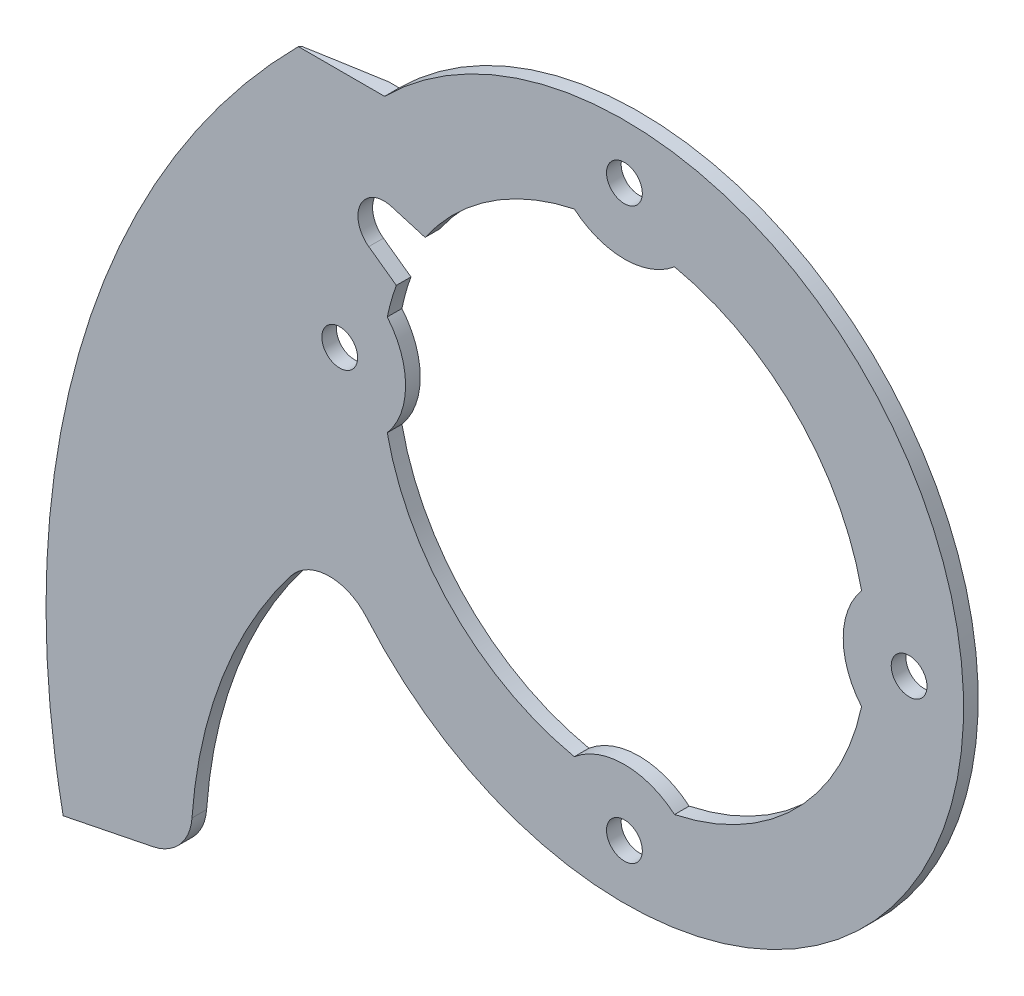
ISO-10303-21;
HEADER;
FILE_DESCRIPTION(('STEP AP214'),'2;1');
FILE_NAME('part.step','',(''),(''),'','','');
FILE_SCHEMA(('AUTOMOTIVE_DESIGN { 1 0 10303 214 1 1 1 1 }'));
ENDSEC;
DATA;
#1=APPLICATION_CONTEXT('core data for automotive mechanical design processes');
#2=APPLICATION_PROTOCOL_DEFINITION('international standard','automotive_design',2000,#1);
#3=PRODUCT_CONTEXT('',#1,'mechanical');
#4=PRODUCT('Part','Part','',(#3));
#5=PRODUCT_RELATED_PRODUCT_CATEGORY('part','',(#4));
#6=PRODUCT_DEFINITION_FORMATION('','',#4);
#7=PRODUCT_DEFINITION_CONTEXT('part definition',#1,'design');
#8=PRODUCT_DEFINITION('design','',#6,#7);
#9=PRODUCT_DEFINITION_SHAPE('','',#8);
#10=(LENGTH_UNIT() NAMED_UNIT(*) SI_UNIT(.MILLI.,.METRE.));
#11=(NAMED_UNIT(*) PLANE_ANGLE_UNIT() SI_UNIT($,.RADIAN.));
#12=(NAMED_UNIT(*) SI_UNIT($,.STERADIAN.) SOLID_ANGLE_UNIT());
#13=UNCERTAINTY_MEASURE_WITH_UNIT(LENGTH_MEASURE(1.E-05),#10,'distance_accuracy_value','');
#14=(GEOMETRIC_REPRESENTATION_CONTEXT(3) GLOBAL_UNCERTAINTY_ASSIGNED_CONTEXT((#13)) GLOBAL_UNIT_ASSIGNED_CONTEXT((#10,
#11,#12)) REPRESENTATION_CONTEXT('',''));
#15=CARTESIAN_POINT('',(0.,0.,0.));
#16=DIRECTION('',(0.,0.,1.));
#17=DIRECTION('',(1.,0.,0.));
#18=AXIS2_PLACEMENT_3D('',#15,#16,#17);
#19=CARTESIAN_POINT('',(17.7955101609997,-22.8663632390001,0.));
#20=DIRECTION('',(0.,0.,1.));
#21=DIRECTION('',(1.,0.,0.));
#22=AXIS2_PLACEMENT_3D('',#19,#20,#21);
#23=CONICAL_SURFACE('',#22,50.150198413,1.32581766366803);
#24=CARTESIAN_POINT('',(-19.9446279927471,14.743176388,0.782537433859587));
#25=CARTESIAN_POINT('',(-19.3538180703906,14.743176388,0.677917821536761));
#26=CARTESIAN_POINT('',(-18.7627981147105,14.743176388,0.574479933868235));
#27=CARTESIAN_POINT('',(-17.7064564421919,14.7431763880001,0.391956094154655));
#28=CARTESIAN_POINT('',(-17.241218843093,14.7431763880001,0.31238291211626));
#29=CARTESIAN_POINT('',(-16.3104542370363,14.7431763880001,0.154911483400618));
#30=CARTESIAN_POINT('',(-15.8449272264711,14.7431763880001,0.0770132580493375));
#31=CARTESIAN_POINT('',(-15.3792532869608,14.7431763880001,-2.00006677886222E-10));
#32=B_SPLINE_CURVE_WITH_KNOTS('',3,(#24,#25,#26,#27,#28,#29,#30,#31),.UNSPECIFIED.,.F.,.F.,(4,2,
2,4),(0.,1.80000381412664,3.21598166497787,4.63197753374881),.UNSPECIFIED.);
#33=CARTESIAN_POINT('',(-19.9446279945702,14.743176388,0.782537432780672));
#34=VERTEX_POINT('',#33);
#35=CARTESIAN_POINT('',(-15.3792532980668,14.7431763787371,-9.99755833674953E-11));
#36=VERTEX_POINT('',#35);
#37=EDGE_CURVE('E38',#34,#36,#32,.T.);
#38=ORIENTED_EDGE('',*,*,#37,.T.);
#39=CARTESIAN_POINT('',(17.7955101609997,-22.8663632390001,0.));
#40=DIRECTION('',(0.,0.,1.));
#41=DIRECTION('',(1.,0.,0.));
#42=AXIS2_PLACEMENT_3D('',#39,#40,#41);
#43=CIRCLE('',#42,50.150198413);
#44=CARTESIAN_POINT('',(-31.3607486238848,-32.8013832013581,0.));
#45=VERTEX_POINT('',#44);
#46=EDGE_CURVE('E377',#36,#45,#43,.T.);
#47=ORIENTED_EDGE('',*,*,#46,.T.);
#48=CARTESIAN_POINT('',(-31.3607486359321,-32.801383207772,7.06931158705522E-13));
#49=CARTESIAN_POINT('',(-31.488586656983,-32.8272206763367,0.032605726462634));
#50=CARTESIAN_POINT('',(-31.6164246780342,-32.8530581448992,0.0652114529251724));
#51=CARTESIAN_POINT('',(-31.8721007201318,-32.9047330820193,0.13042290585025));
#52=CARTESIAN_POINT('',(-31.9999387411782,-32.9305705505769,0.163028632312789));
#53=CARTESIAN_POINT('',(-32.2556147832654,-32.982245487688,0.228240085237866));
#54=CARTESIAN_POINT('',(-32.3834528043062,-33.0080829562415,0.260845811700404));
#55=CARTESIAN_POINT('',(-32.6391288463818,-33.059757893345,0.326057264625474));
#56=CARTESIAN_POINT('',(-32.7669668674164,-33.085595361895,0.358662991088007));
#57=CARTESIAN_POINT('',(-33.0226429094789,-33.1372702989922,0.423874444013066));
#58=CARTESIAN_POINT('',(-33.1504809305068,-33.1631077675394,0.456480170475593));
#59=CARTESIAN_POINT('',(-33.4061569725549,-33.2147827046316,0.521691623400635));
#60=CARTESIAN_POINT('',(-33.5339949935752,-33.2406201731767,0.554297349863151));
#61=CARTESIAN_POINT('',(-33.7896710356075,-33.2922951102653,0.619508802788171));
#62=CARTESIAN_POINT('',(-33.9175090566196,-33.3181325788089,0.652114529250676));
#63=CARTESIAN_POINT('',(-34.1731850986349,-33.3698075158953,0.717325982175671));
#64=CARTESIAN_POINT('',(-34.3010231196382,-33.3956449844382,0.749931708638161));
#65=CARTESIAN_POINT('',(-34.4288611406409,-33.4214824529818,0.782537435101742));
#66=B_SPLINE_CURVE_WITH_KNOTS('',3,(#48,#49,#50,#51,#52,#53,#54,#55,#56,#57,#58,#59,#60,#61,#62,
#63,#64,#65),.UNSPECIFIED.,.F.,.F.,(4,2,2,2,2,2,2,2,4),(0.,0.403310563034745,0.806621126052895,
1.20993168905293,1.61324225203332,2.01655281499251,2.41986337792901,2.82317394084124,
3.22648450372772),.UNSPECIFIED.);
#67=CARTESIAN_POINT('',(-34.4288611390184,-33.4214824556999,0.782537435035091));
#68=VERTEX_POINT('',#67);
#69=EDGE_CURVE('E319',#45,#68,#66,.T.);
#70=ORIENTED_EDGE('',*,*,#69,.T.);
#71=CARTESIAN_POINT('',(17.7955101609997,-22.8663632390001,0.782537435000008));
#72=DIRECTION('',(0.,0.,1.));
#73=DIRECTION('',(1.,0.,0.));
#74=AXIS2_PLACEMENT_3D('',#71,#72,#73);
#75=CIRCLE('',#74,53.280348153);
#76=EDGE_CURVE('E181',#34,#68,#75,.T.);
#77=ORIENTED_EDGE('',*,*,#76,.F.);
#78=EDGE_LOOP('',(#38,#47,#70,#77));
#79=FACE_BOUND('',#78,.T.);
#80=ADVANCED_FACE('F34',(#79),#23,.T.);
#81=CARTESIAN_POINT('',(-28.97955061,-32.320116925,0.));
#82=DIRECTION('',(-0.198105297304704,0.980180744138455,0.));
#83=DIRECTION('',(-0.980180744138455,-0.198105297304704,0.));
#84=AXIS2_PLACEMENT_3D('',#81,#82,#83);
#85=PLANE('',#84);
#86=DIRECTION('',(0.,0.,-1.));
#87=VECTOR('',#86,1.);
#88=CARTESIAN_POINT('',(-28.9795506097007,-32.3201169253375,0.450000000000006));
#89=LINE('',#88,#87);
#90=CARTESIAN_POINT('',(-28.9795506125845,-32.3201169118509,0.899999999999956));
#91=VERTEX_POINT('',#90);
#92=CARTESIAN_POINT('',(-28.9795506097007,-32.3201169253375,0.));
#93=VERTEX_POINT('',#92);
#94=EDGE_CURVE('E317',#91,#93,#89,.T.);
#95=ORIENTED_EDGE('',*,*,#94,.F.);
#96=CARTESIAN_POINT('',(-34.4973270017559,-33.4353201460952,0.900000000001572));
#97=CARTESIAN_POINT('',(-34.2674196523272,-33.3888533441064,0.900000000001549));
#98=CARTESIAN_POINT('',(-34.0375123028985,-33.3423865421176,0.900000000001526));
#99=CARTESIAN_POINT('',(-33.5776976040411,-33.2494529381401,0.900000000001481));
#100=CARTESIAN_POINT('',(-33.3477902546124,-33.2029861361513,0.900000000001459));
#101=CARTESIAN_POINT('',(-32.887975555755,-33.1100525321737,0.900000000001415));
#102=CARTESIAN_POINT('',(-32.6580682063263,-33.0635857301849,0.900000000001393));
#103=CARTESIAN_POINT('',(-32.1982535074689,-32.9706521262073,0.900000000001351));
#104=CARTESIAN_POINT('',(-31.9683461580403,-32.9241853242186,0.900000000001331));
#105=CARTESIAN_POINT('',(-31.508531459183,-32.831251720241,0.900000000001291));
#106=CARTESIAN_POINT('',(-31.2786241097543,-32.7847849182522,0.900000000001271));
#107=CARTESIAN_POINT('',(-30.8188094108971,-32.6918513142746,0.900000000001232));
#108=CARTESIAN_POINT('',(-30.5889020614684,-32.6453845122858,0.900000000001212));
#109=CARTESIAN_POINT('',(-30.1290873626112,-32.5524509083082,0.900000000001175));
#110=CARTESIAN_POINT('',(-29.8991800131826,-32.5059841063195,0.900000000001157));
#111=CARTESIAN_POINT('',(-29.4393653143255,-32.4130505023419,0.90000000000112));
#112=CARTESIAN_POINT('',(-29.2094579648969,-32.3665837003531,0.900000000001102));
#113=CARTESIAN_POINT('',(-28.9795506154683,-32.3201168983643,0.900000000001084));
#114=B_SPLINE_CURVE_WITH_KNOTS('',3,(#96,#97,#98,#99,#100,#101,#102,#103,#104,#105,#106,#107,
#108,#109,#110,#111,#112,#113),.UNSPECIFIED.,.F.,.F.,(4,2,2,2,2,2,2,2,4),(0.,0.70366822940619,
1.40733645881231,2.11100468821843,2.81467291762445,3.51834114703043,4.22200937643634,
4.92567760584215,5.62934583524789),.UNSPECIFIED.);
#115=CARTESIAN_POINT('',(-34.4973270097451,-33.4353201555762,0.89947726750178));
#116=VERTEX_POINT('',#115);
#117=EDGE_CURVE('E263',#116,#91,#114,.T.);
#118=ORIENTED_EDGE('',*,*,#117,.F.);
#119=DIRECTION('',(-0.504298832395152,-0.1019243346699,0.857492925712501));
#120=VECTOR('',#119,1.);
#121=CARTESIAN_POINT('',(-34.4630940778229,-33.4284013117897,0.840745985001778));
#122=LINE('',#121,#120);
#123=EDGE_CURVE('E204',#68,#116,#122,.T.);
#124=ORIENTED_EDGE('',*,*,#123,.F.);
#125=ORIENTED_EDGE('',*,*,#69,.F.);
#126=CARTESIAN_POINT('',(-31.3607486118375,-32.8013831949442,1.60786851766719E-12));
#127=CARTESIAN_POINT('',(-31.2615320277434,-32.7813304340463,1.59698065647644E-12));
#128=CARTESIAN_POINT('',(-31.1623154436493,-32.7612776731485,1.58617665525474E-12));
#129=CARTESIAN_POINT('',(-30.9638822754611,-32.7211721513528,1.56473456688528E-12));
#130=CARTESIAN_POINT('',(-30.864665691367,-32.7011193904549,1.55409647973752E-12));
#131=CARTESIAN_POINT('',(-30.6662325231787,-32.6610138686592,1.53298441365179E-12));
#132=CARTESIAN_POINT('',(-30.5670159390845,-32.6409611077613,1.52251043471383E-12));
#133=CARTESIAN_POINT('',(-30.3685827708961,-32.6008555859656,1.50172479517E-12));
#134=CARTESIAN_POINT('',(-30.2693661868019,-32.5808028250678,1.49141313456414E-12));
#135=CARTESIAN_POINT('',(-30.0709330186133,-32.5406973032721,1.47095035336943E-12));
#136=CARTESIAN_POINT('',(-29.971716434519,-32.5206445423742,1.46079923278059E-12));
#137=CARTESIAN_POINT('',(-29.7732832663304,-32.4805390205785,1.44065576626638E-12));
#138=CARTESIAN_POINT('',(-29.6740666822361,-32.4604862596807,1.43066342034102E-12));
#139=CARTESIAN_POINT('',(-29.4756335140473,-32.420380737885,1.41083574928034E-12));
#140=CARTESIAN_POINT('',(-29.3764169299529,-32.4003279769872,1.40100042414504E-12));
#141=CARTESIAN_POINT('',(-29.1779837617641,-32.3602224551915,1.38148505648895E-12));
#142=CARTESIAN_POINT('',(-29.0787671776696,-32.3401696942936,1.37180501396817E-12));
#143=CARTESIAN_POINT('',(-28.9795505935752,-32.3201169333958,1.36220174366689E-12));
#144=B_SPLINE_CURVE_WITH_KNOTS('',3,(#126,#127,#128,#129,#130,#131,#132,#133,#134,#135,#136,
#137,#138,#139,#140,#141,#142,#143),.UNSPECIFIED.,.F.,.F.,(4,2,2,2,2,2,2,2,4),(0.,
0.303668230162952,0.607336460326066,0.911004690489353,1.21467292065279,1.51834115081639,
1.82200938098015,2.12567761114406,2.42934584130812),.UNSPECIFIED.);
#145=EDGE_CURVE('E380',#45,#93,#144,.T.);
#146=ORIENTED_EDGE('',*,*,#145,.T.);
#147=EDGE_LOOP('',(#95,#118,#124,#125,#146));
#148=FACE_BOUND('',#147,.T.);
#149=ADVANCED_FACE('F345',(#148),#85,.F.);
#150=CARTESIAN_POINT('',(-29.573866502,-29.379574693,0.899999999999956));
#151=DIRECTION('',(0.,0.,-1.));
#152=DIRECTION('',(-1.,0.,0.));
#153=AXIS2_PLACEMENT_3D('',#150,#151,#152);
#154=CYLINDRICAL_SURFACE('',#153,3.);
#155=CARTESIAN_POINT('',(-29.573866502,-29.379574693,0.));
#156=DIRECTION('',(0.,0.,-1.));
#157=DIRECTION('',(-1.,0.,0.));
#158=AXIS2_PLACEMENT_3D('',#155,#156,#157);
#159=CIRCLE('',#158,3.);
#160=CARTESIAN_POINT('',(-26.5814833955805,-29.5932177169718,0.));
#161=VERTEX_POINT('',#160);
#162=EDGE_CURVE('E381',#93,#161,#159,.F.);
#163=ORIENTED_EDGE('',*,*,#162,.T.);
#164=DIRECTION('',(0.,0.,1.));
#165=VECTOR('',#164,1.);
#166=CARTESIAN_POINT('',(-26.5814833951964,-29.5932177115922,0.450000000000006));
#167=LINE('',#166,#165);
#168=CARTESIAN_POINT('',(-26.5814833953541,-29.593217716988,0.900000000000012));
#169=VERTEX_POINT('',#168);
#170=EDGE_CURVE('E314',#161,#169,#167,.T.);
#171=ORIENTED_EDGE('',*,*,#170,.T.);
#172=CARTESIAN_POINT('',(-29.573866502,-29.379574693,0.899999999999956));
#173=DIRECTION('',(0.,0.,-1.));
#174=DIRECTION('',(-1.,0.,0.));
#175=AXIS2_PLACEMENT_3D('',#172,#173,#174);
#176=CIRCLE('',#175,3.);
#177=EDGE_CURVE('E265',#91,#169,#176,.F.);
#178=ORIENTED_EDGE('',*,*,#177,.F.);
#179=ORIENTED_EDGE('',*,*,#94,.T.);
#180=EDGE_LOOP('',(#163,#171,#178,#179));
#181=FACE_BOUND('',#180,.T.);
#182=ADVANCED_FACE('F336',(#181),#154,.T.);
#183=CARTESIAN_POINT('',(2.81403907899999,-31.6919291,0.900000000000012));
#184=DIRECTION('',(0.,0.,-1.));
#185=DIRECTION('',(-1.,0.,0.));
#186=AXIS2_PLACEMENT_3D('',#183,#184,#185);
#187=CYLINDRICAL_SURFACE('',#186,29.470346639);
#188=ORIENTED_EDGE('',*,*,#170,.F.);
#189=CARTESIAN_POINT('',(2.81403907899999,-31.6919291,0.));
#190=DIRECTION('',(0.,0.,-1.));
#191=DIRECTION('',(-1.,0.,0.));
#192=AXIS2_PLACEMENT_3D('',#189,#190,#191);
#193=CIRCLE('',#192,29.470346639);
#194=CARTESIAN_POINT('',(-20.4997424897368,-13.665034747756,0.));
#195=VERTEX_POINT('',#194);
#196=EDGE_CURVE('E384',#161,#195,#193,.T.);
#197=ORIENTED_EDGE('',*,*,#196,.T.);
#198=DIRECTION('',(0.,0.,1.));
#199=VECTOR('',#198,1.);
#200=CARTESIAN_POINT('',(-20.4997424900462,-13.6650347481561,0.450000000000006));
#201=LINE('',#200,#199);
#202=CARTESIAN_POINT('',(-20.499742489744,-13.6650347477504,0.900000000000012));
#203=VERTEX_POINT('',#202);
#204=EDGE_CURVE('E311',#195,#203,#201,.T.);
#205=ORIENTED_EDGE('',*,*,#204,.T.);
#206=CARTESIAN_POINT('',(2.81403907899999,-31.6919291,0.900000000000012));
#207=DIRECTION('',(0.,0.,-1.));
#208=DIRECTION('',(-1.,0.,0.));
#209=AXIS2_PLACEMENT_3D('',#206,#207,#208);
#210=CIRCLE('',#209,29.470346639);
#211=EDGE_CURVE('E427',#169,#203,#210,.T.);
#212=ORIENTED_EDGE('',*,*,#211,.F.);
#213=EDGE_LOOP('',(#188,#197,#205,#212));
#214=FACE_BOUND('',#213,.T.);
#215=ADVANCED_FACE('F344',(#214),#187,.F.);
#216=CARTESIAN_POINT('',(-18.126463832,-15.500122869,0.900000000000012));
#217=DIRECTION('',(0.,0.,-1.));
#218=DIRECTION('',(-1.,0.,0.));
#219=AXIS2_PLACEMENT_3D('',#216,#217,#218);
#220=CYLINDRICAL_SURFACE('',#219,3.);
#221=ORIENTED_EDGE('',*,*,#204,.F.);
#222=CARTESIAN_POINT('',(-18.126463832,-15.500122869,0.));
#223=DIRECTION('',(0.,0.,-1.));
#224=DIRECTION('',(-1.,0.,0.));
#225=AXIS2_PLACEMENT_3D('',#222,#223,#224);
#226=CIRCLE('',#225,3.);
#227=CARTESIAN_POINT('',(-15.8464054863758,-13.5504218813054,0.));
#228=VERTEX_POINT('',#227);
#229=EDGE_CURVE('E276',#195,#228,#226,.T.);
#230=ORIENTED_EDGE('',*,*,#229,.T.);
#231=DIRECTION('',(0.,0.,-1.));
#232=VECTOR('',#231,1.);
#233=CARTESIAN_POINT('',(-15.8464054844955,-13.5504218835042,0.450000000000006));
#234=LINE('',#233,#232);
#235=CARTESIAN_POINT('',(-15.8464054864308,-13.5504218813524,0.900000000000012));
#236=VERTEX_POINT('',#235);
#237=EDGE_CURVE('E309',#236,#228,#234,.T.);
#238=ORIENTED_EDGE('',*,*,#237,.F.);
#239=CARTESIAN_POINT('',(-18.126463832,-15.500122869,0.900000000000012));
#240=DIRECTION('',(0.,0.,-1.));
#241=DIRECTION('',(-1.,0.,0.));
#242=AXIS2_PLACEMENT_3D('',#239,#240,#241);
#243=CIRCLE('',#242,3.);
#244=EDGE_CURVE('E429',#203,#236,#243,.T.);
#245=ORIENTED_EDGE('',*,*,#244,.F.);
#246=EDGE_LOOP('',(#221,#230,#238,#245));
#247=FACE_BOUND('',#246,.T.);
#248=ADVANCED_FACE('F349',(#247),#220,.F.);
#249=CARTESIAN_POINT('',(0.,0.,0.900000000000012));
#250=DIRECTION('',(0.,0.,-1.));
#251=DIRECTION('',(-1.,0.,0.));
#252=AXIS2_PLACEMENT_3D('',#249,#250,#251);
#253=CYLINDRICAL_SURFACE('',#252,20.85);
#254=CARTESIAN_POINT('',(0.,0.,0.));
#255=DIRECTION('',(0.,0.,-1.));
#256=DIRECTION('',(-1.,0.,0.));
#257=AXIS2_PLACEMENT_3D('',#254,#255,#256);
#258=CIRCLE('',#257,20.85);
#259=CARTESIAN_POINT('',(-14.7431763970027,14.7431763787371,0.));
#260=VERTEX_POINT('',#259);
#261=EDGE_CURVE('E373',#228,#260,#258,.F.);
#262=ORIENTED_EDGE('',*,*,#261,.T.);
#263=DIRECTION('',(0.,0.,1.));
#264=VECTOR('',#263,1.);
#265=CARTESIAN_POINT('',(-14.7431763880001,14.7431763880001,0.450000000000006));
#266=LINE('',#265,#264);
#267=CARTESIAN_POINT('',(-14.7431763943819,14.7431763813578,0.900000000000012));
#268=VERTEX_POINT('',#267);
#269=EDGE_CURVE('E306',#260,#268,#266,.T.);
#270=ORIENTED_EDGE('',*,*,#269,.T.);
#271=CARTESIAN_POINT('',(0.,0.,0.900000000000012));
#272=DIRECTION('',(0.,0.,-1.));
#273=DIRECTION('',(-1.,0.,0.));
#274=AXIS2_PLACEMENT_3D('',#271,#272,#273);
#275=CIRCLE('',#274,20.85);
#276=EDGE_CURVE('E262',#236,#268,#275,.F.);
#277=ORIENTED_EDGE('',*,*,#276,.F.);
#278=ORIENTED_EDGE('',*,*,#237,.T.);
#279=EDGE_LOOP('',(#262,#270,#277,#278));
#280=FACE_BOUND('',#279,.T.);
#281=ADVANCED_FACE('F353',(#280),#253,.T.);
#282=CARTESIAN_POINT('',(-20.09617638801,14.743176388,0.));
#283=DIRECTION('',(0.,-1.,0.));
#284=DIRECTION('',(1.,0.,0.));
#285=AXIS2_PLACEMENT_3D('',#282,#283,#284);
#286=PLANE('',#285);
#287=CARTESIAN_POINT('',(-20.0431763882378,14.7431763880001,0.898954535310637));
#288=CARTESIAN_POINT('',(-20.0103269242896,14.7431763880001,0.860148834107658));
#289=CARTESIAN_POINT('',(-19.9774774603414,14.7431763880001,0.82134313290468));
#290=CARTESIAN_POINT('',(-19.9446279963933,14.7431763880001,0.782537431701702));
#291=B_SPLINE_CURVE_WITH_KNOTS('',3,(#287,#288,#289,#290),.UNSPECIFIED.,.F.,.F.,(4,4),(0.,
0.152527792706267),.UNSPECIFIED.);
#292=CARTESIAN_POINT('',(-20.0431763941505,14.743176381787,0.898954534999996));
#293=VERTEX_POINT('',#292);
#294=EDGE_CURVE('E305',#293,#34,#291,.T.);
#295=ORIENTED_EDGE('',*,*,#294,.F.);
#296=DIRECTION('',(0.,0.,-1.));
#297=VECTOR('',#296,1.);
#298=CARTESIAN_POINT('',(-20.0431764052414,14.7431763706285,0.899477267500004));
#299=LINE('',#298,#297);
#300=CARTESIAN_POINT('',(-20.0431764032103,14.743176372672,0.900000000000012));
#301=VERTEX_POINT('',#300);
#302=EDGE_CURVE('E202',#301,#293,#299,.T.);
#303=ORIENTED_EDGE('',*,*,#302,.F.);
#304=DIRECTION('',(-1.,0.,0.));
#305=VECTOR('',#304,1.);
#306=CARTESIAN_POINT('',(-7.36945572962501,14.7431763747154,0.900000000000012));
#307=LINE('',#306,#305);
#308=EDGE_CURVE('E195',#268,#301,#307,.T.);
#309=ORIENTED_EDGE('',*,*,#308,.F.);
#310=ORIENTED_EDGE('',*,*,#269,.F.);
#311=DIRECTION('',(-1.,0.,0.));
#312=VECTOR('',#311,1.);
#313=CARTESIAN_POINT('',(-5.7813452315,14.7431763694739,0.));
#314=LINE('',#313,#312);
#315=EDGE_CURVE('E376',#260,#36,#314,.T.);
#316=ORIENTED_EDGE('',*,*,#315,.T.);
#317=ORIENTED_EDGE('',*,*,#37,.F.);
#318=EDGE_LOOP('',(#295,#303,#309,#310,#316,#317));
#319=FACE_BOUND('',#318,.T.);
#320=ADVANCED_FACE('F356',(#319),#286,.F.);
#321=CARTESIAN_POINT('',(17.7955101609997,-22.8663632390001,0.900000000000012));
#322=DIRECTION('',(0.,0.,-1.));
#323=DIRECTION('',(-1.,0.,0.));
#324=AXIS2_PLACEMENT_3D('',#321,#322,#323);
#325=CYLINDRICAL_SURFACE('',#324,53.350198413);
#326=ORIENTED_EDGE('',*,*,#302,.T.);
#327=CARTESIAN_POINT('',(17.7955101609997,-22.8663632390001,0.898954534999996));
#328=DIRECTION('',(0.,0.,1.));
#329=DIRECTION('',(1.,0.,0.));
#330=AXIS2_PLACEMENT_3D('',#327,#328,#329);
#331=CIRCLE('',#330,53.350198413);
#332=CARTESIAN_POINT('',(-35.5546882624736,-22.8663632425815,0.899581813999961));
#333=VERTEX_POINT('',#332);
#334=EDGE_CURVE('E200',#333,#293,#331,.F.);
#335=ORIENTED_EDGE('',*,*,#334,.F.);
#336=CARTESIAN_POINT('',(17.7955101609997,-22.8663632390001,0.900000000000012));
#337=DIRECTION('',(0.,0.,-1.));
#338=DIRECTION('',(-1.,0.,0.));
#339=AXIS2_PLACEMENT_3D('',#336,#337,#338);
#340=CIRCLE('',#339,53.350198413);
#341=EDGE_CURVE('E189',#301,#333,#340,.F.);
#342=ORIENTED_EDGE('',*,*,#341,.F.);
#343=EDGE_LOOP('',(#326,#335,#342));
#344=FACE_BOUND('',#343,.T.);
#345=ADVANCED_FACE('F201',(#344),#325,.T.);
#346=CARTESIAN_POINT('',(17.7955101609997,-22.8663632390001,0.782537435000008));
#347=DIRECTION('',(0.,0.,1.));
#348=DIRECTION('',(0.,-1.,0.));
#349=AXIS2_PLACEMENT_3D('',#346,#347,#348);
#350=CONICAL_SURFACE('',#349,53.280348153,0.540419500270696);
#351=CARTESIAN_POINT('',(-35.555315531,-22.8663632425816,0.900000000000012));
#352=CARTESIAN_POINT('',(-35.555315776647,-23.16265173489,0.900000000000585));
#353=CARTESIAN_POINT('',(-35.5528473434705,-23.4589402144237,0.90000000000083));
#354=CARTESIAN_POINT('',(-35.5429816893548,-24.0510265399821,0.900000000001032));
#355=CARTESIAN_POINT('',(-35.5355912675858,-24.3468244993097,0.900000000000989));
#356=CARTESIAN_POINT('',(-35.5159010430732,-24.9379306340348,0.900000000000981));
#357=CARTESIAN_POINT('',(-35.5036066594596,-25.2332389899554,0.900000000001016));
#358=CARTESIAN_POINT('',(-35.4741241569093,-25.8233666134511,0.900000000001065));
#359=CARTESIAN_POINT('',(-35.4569400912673,-26.118186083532,0.90000000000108));
#360=CARTESIAN_POINT('',(-35.4176896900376,-26.7073364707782,0.900000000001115));
#361=CARTESIAN_POINT('',(-35.3956260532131,-27.0016675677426,0.900000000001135));
#362=CARTESIAN_POINT('',(-35.3466239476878,-27.5898415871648,0.900000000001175));
#363=CARTESIAN_POINT('',(-35.3196868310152,-27.8836846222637,0.900000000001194));
#364=CARTESIAN_POINT('',(-35.2609410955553,-28.4708833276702,0.900000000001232));
#365=CARTESIAN_POINT('',(-35.229132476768,-28.7642389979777,0.900000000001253));
#366=CARTESIAN_POINT('',(-35.1606430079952,-29.3504634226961,0.900000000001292));
#367=CARTESIAN_POINT('',(-35.123960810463,-29.6433320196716,0.900000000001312));
#368=CARTESIAN_POINT('',(-35.0457194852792,-30.2285815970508,0.900000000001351));
#369=CARTESIAN_POINT('',(-35.0041576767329,-30.5209622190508,0.90000000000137));
#370=CARTESIAN_POINT('',(-34.9161484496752,-31.1052345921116,0.900000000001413));
#371=CARTESIAN_POINT('',(-34.869697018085,-31.3971257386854,0.900000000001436));
#372=CARTESIAN_POINT('',(-34.7718957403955,-31.9804173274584,0.900000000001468));
#373=CARTESIAN_POINT('',(-34.7205405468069,-32.2718168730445,0.900000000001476));
#374=CARTESIAN_POINT('',(-34.6129152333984,-32.8541229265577,0.900000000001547));
#375=CARTESIAN_POINT('',(-34.5566384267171,-33.1450281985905,0.900000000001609));
#376=CARTESIAN_POINT('',(-34.4979418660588,-33.4354444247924,0.900000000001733));
#377=B_SPLINE_CURVE_WITH_KNOTS('',3,(#351,#352,#353,#354,#355,#356,#357,#358,#359,#360,#361,
#362,#363,#364,#365,#366,#367,#368,#369,#370,#371,#372,#373,#374,#375,#376),.UNSPECIFIED.,.F.,
.F.,(4,2,2,2,2,2,2,2,2,2,2,2,4),(0.,0.88885516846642,1.77648502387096,2.66313670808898,
3.54905553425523,4.43448560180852,5.31967040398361,6.20485520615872,7.090285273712,
7.97620409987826,8.86285578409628,9.75048563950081,10.6393408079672),.UNSPECIFIED.);
#378=EDGE_CURVE('E192',#333,#116,#377,.T.);
#379=ORIENTED_EDGE('',*,*,#378,.F.);
#380=ORIENTED_EDGE('',*,*,#334,.T.);
#381=ORIENTED_EDGE('',*,*,#294,.T.);
#382=ORIENTED_EDGE('',*,*,#76,.T.);
#383=ORIENTED_EDGE('',*,*,#123,.T.);
#384=EDGE_LOOP('',(#379,#380,#381,#382,#383));
#385=FACE_BOUND('',#384,.T.);
#386=ADVANCED_FACE('F206',(#385),#350,.T.);
#387=CARTESIAN_POINT('',(0.,18.22,0.900000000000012));
#388=DIRECTION('',(0.,0.,-1.));
#389=DIRECTION('',(-1.,0.,0.));
#390=AXIS2_PLACEMENT_3D('',#387,#388,#389);
#391=CYLINDRICAL_SURFACE('',#390,4.77);
#392=CARTESIAN_POINT('',(0.,18.22,0.900000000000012));
#393=DIRECTION('',(0.,0.,-1.));
#394=DIRECTION('',(-1.,0.,0.));
#395=AXIS2_PLACEMENT_3D('',#392,#393,#394);
#396=CIRCLE('',#395,4.77);
#397=CARTESIAN_POINT('',(-3.08048236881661,14.5780872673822,0.900000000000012));
#398=VERTEX_POINT('',#397);
#399=CARTESIAN_POINT('',(3.08048237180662,14.5780872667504,0.900000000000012));
#400=VERTEX_POINT('',#399);
#401=EDGE_CURVE('E208',#398,#400,#396,.F.);
#402=ORIENTED_EDGE('',*,*,#401,.F.);
#403=DIRECTION('',(0.,0.,-1.));
#404=VECTOR('',#403,1.);
#405=CARTESIAN_POINT('',(-3.08048236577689,14.5780872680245,0.450000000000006));
#406=LINE('',#405,#404);
#407=CARTESIAN_POINT('',(-3.08048236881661,14.5780872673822,0.));
#408=VERTEX_POINT('',#407);
#409=EDGE_CURVE('E271',#398,#408,#406,.T.);
#410=ORIENTED_EDGE('',*,*,#409,.T.);
#411=CARTESIAN_POINT('',(0.,18.22,0.));
#412=DIRECTION('',(0.,0.,-1.));
#413=DIRECTION('',(-1.,0.,0.));
#414=AXIS2_PLACEMENT_3D('',#411,#412,#413);
#415=CIRCLE('',#414,4.77);
#416=CARTESIAN_POINT('',(3.08048237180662,14.5780872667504,0.));
#417=VERTEX_POINT('',#416);
#418=EDGE_CURVE('E421',#408,#417,#415,.F.);
#419=ORIENTED_EDGE('',*,*,#418,.T.);
#420=DIRECTION('',(0.,0.,1.));
#421=VECTOR('',#420,1.);
#422=CARTESIAN_POINT('',(3.08048237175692,14.5780872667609,0.450000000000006));
#423=LINE('',#422,#421);
#424=EDGE_CURVE('E203',#417,#400,#423,.T.);
#425=ORIENTED_EDGE('',*,*,#424,.T.);
#426=EDGE_LOOP('',(#402,#410,#419,#425));
#427=FACE_BOUND('',#426,.T.);
#428=ADVANCED_FACE('F531',(#427),#391,.T.);
#429=CARTESIAN_POINT('',(0.,0.,0.900000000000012));
#430=DIRECTION('',(0.,0.,-1.));
#431=DIRECTION('',(-1.,0.,0.));
#432=AXIS2_PLACEMENT_3D('',#429,#430,#431);
#433=CYLINDRICAL_SURFACE('',#432,14.9);
#434=DIRECTION('',(0.,0.,-1.));
#435=VECTOR('',#434,1.);
#436=CARTESIAN_POINT('',(14.5780872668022,3.0804823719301,0.450000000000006));
#437=LINE('',#436,#435);
#438=CARTESIAN_POINT('',(14.578087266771,3.08048237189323,0.900000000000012));
#439=VERTEX_POINT('',#438);
#440=CARTESIAN_POINT('',(14.578087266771,3.08048237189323,0.));
#441=VERTEX_POINT('',#440);
#442=EDGE_CURVE('E294',#439,#441,#437,.T.);
#443=ORIENTED_EDGE('',*,*,#442,.F.);
#444=CARTESIAN_POINT('',(0.,0.,0.900000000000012));
#445=DIRECTION('',(0.,0.,-1.));
#446=DIRECTION('',(-1.,0.,0.));
#447=AXIS2_PLACEMENT_3D('',#444,#445,#446);
#448=CIRCLE('',#447,14.9);
#449=EDGE_CURVE('E210',#400,#439,#448,.T.);
#450=ORIENTED_EDGE('',*,*,#449,.F.);
#451=ORIENTED_EDGE('',*,*,#424,.F.);
#452=CARTESIAN_POINT('',(0.,0.,0.));
#453=DIRECTION('',(0.,0.,-1.));
#454=DIRECTION('',(-1.,0.,0.));
#455=AXIS2_PLACEMENT_3D('',#452,#453,#454);
#456=CIRCLE('',#455,14.9);
#457=EDGE_CURVE('E279',#417,#441,#456,.T.);
#458=ORIENTED_EDGE('',*,*,#457,.T.);
#459=EDGE_LOOP('',(#443,#450,#451,#458));
#460=FACE_BOUND('',#459,.T.);
#461=ADVANCED_FACE('F504',(#460),#433,.F.);
#462=CARTESIAN_POINT('',(18.22,0.,0.900000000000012));
#463=DIRECTION('',(0.,0.,-1.));
#464=DIRECTION('',(-1.,0.,0.));
#465=AXIS2_PLACEMENT_3D('',#462,#463,#464);
#466=CYLINDRICAL_SURFACE('',#465,4.77);
#467=CARTESIAN_POINT('',(18.22,0.,0.));
#468=DIRECTION('',(0.,0.,-1.));
#469=DIRECTION('',(-1.,0.,0.));
#470=AXIS2_PLACEMENT_3D('',#467,#468,#469);
#471=CIRCLE('',#470,4.77);
#472=CARTESIAN_POINT('',(14.5780872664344,-3.08048237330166,0.));
#473=VERTEX_POINT('',#472);
#474=EDGE_CURVE('E399',#441,#473,#471,.F.);
#475=ORIENTED_EDGE('',*,*,#474,.T.);
#476=DIRECTION('',(0.,0.,1.));
#477=VECTOR('',#476,1.);
#478=CARTESIAN_POINT('',(14.578087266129,-3.08048237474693,0.450000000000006));
#479=LINE('',#478,#477);
#480=CARTESIAN_POINT('',(14.5780872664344,-3.08048237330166,0.900000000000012));
#481=VERTEX_POINT('',#480);
#482=EDGE_CURVE('E291',#473,#481,#479,.T.);
#483=ORIENTED_EDGE('',*,*,#482,.T.);
#484=CARTESIAN_POINT('',(18.22,0.,0.900000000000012));
#485=DIRECTION('',(0.,0.,-1.));
#486=DIRECTION('',(-1.,0.,0.));
#487=AXIS2_PLACEMENT_3D('',#484,#485,#486);
#488=CIRCLE('',#487,4.77);
#489=EDGE_CURVE('E497',#439,#481,#488,.F.);
#490=ORIENTED_EDGE('',*,*,#489,.F.);
#491=ORIENTED_EDGE('',*,*,#442,.T.);
#492=EDGE_LOOP('',(#475,#483,#490,#491));
#493=FACE_BOUND('',#492,.T.);
#494=ADVANCED_FACE('F507',(#493),#466,.T.);
#495=CARTESIAN_POINT('',(0.,0.,0.900000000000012));
#496=DIRECTION('',(0.,0.,-1.));
#497=DIRECTION('',(-1.,0.,0.));
#498=AXIS2_PLACEMENT_3D('',#495,#496,#497);
#499=CYLINDRICAL_SURFACE('',#498,14.9);
#500=DIRECTION('',(0.,0.,-1.));
#501=VECTOR('',#500,1.);
#502=CARTESIAN_POINT('',(3.08048237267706,-14.5780872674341,0.450000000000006));
#503=LINE('',#502,#501);
#504=CARTESIAN_POINT('',(3.0804823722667,-14.578087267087,0.900000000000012));
#505=VERTEX_POINT('',#504);
#506=CARTESIAN_POINT('',(3.0804823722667,-14.578087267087,0.));
#507=VERTEX_POINT('',#506);
#508=EDGE_CURVE('E289',#505,#507,#503,.T.);
#509=ORIENTED_EDGE('',*,*,#508,.F.);
#510=CARTESIAN_POINT('',(0.,0.,0.900000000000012));
#511=DIRECTION('',(0.,0.,-1.));
#512=DIRECTION('',(-1.,0.,0.));
#513=AXIS2_PLACEMENT_3D('',#510,#511,#512);
#514=CIRCLE('',#513,14.9);
#515=EDGE_CURVE('E495',#481,#505,#514,.T.);
#516=ORIENTED_EDGE('',*,*,#515,.F.);
#517=ORIENTED_EDGE('',*,*,#482,.F.);
#518=CARTESIAN_POINT('',(0.,0.,0.));
#519=DIRECTION('',(0.,0.,-1.));
#520=DIRECTION('',(-1.,0.,0.));
#521=AXIS2_PLACEMENT_3D('',#518,#519,#520);
#522=CIRCLE('',#521,14.9);
#523=EDGE_CURVE('E402',#473,#507,#522,.T.);
#524=ORIENTED_EDGE('',*,*,#523,.T.);
#525=EDGE_LOOP('',(#509,#516,#517,#524));
#526=FACE_BOUND('',#525,.T.);
#527=ADVANCED_FACE('F512',(#526),#499,.F.);
#528=CARTESIAN_POINT('',(0.,-18.22,0.900000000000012));
#529=DIRECTION('',(0.,0.,-1.));
#530=DIRECTION('',(-1.,0.,0.));
#531=AXIS2_PLACEMENT_3D('',#528,#529,#530);
#532=CYLINDRICAL_SURFACE('',#531,4.77);
#533=CARTESIAN_POINT('',(0.,-18.22,0.900000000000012));
#534=DIRECTION('',(0.,0.,-1.));
#535=DIRECTION('',(-1.,0.,0.));
#536=AXIS2_PLACEMENT_3D('',#533,#534,#535);
#537=CIRCLE('',#536,4.77);
#538=CARTESIAN_POINT('',(-3.08048237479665,-14.5780872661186,0.900000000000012));
#539=VERTEX_POINT('',#538);
#540=EDGE_CURVE('E493',#505,#539,#537,.F.);
#541=ORIENTED_EDGE('',*,*,#540,.F.);
#542=ORIENTED_EDGE('',*,*,#508,.T.);
#543=CARTESIAN_POINT('',(0.,-18.22,0.));
#544=DIRECTION('',(0.,0.,-1.));
#545=DIRECTION('',(-1.,0.,0.));
#546=AXIS2_PLACEMENT_3D('',#543,#544,#545);
#547=CIRCLE('',#546,4.77);
#548=CARTESIAN_POINT('',(-3.08048237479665,-14.5780872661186,0.));
#549=VERTEX_POINT('',#548);
#550=EDGE_CURVE('E405',#507,#549,#547,.F.);
#551=ORIENTED_EDGE('',*,*,#550,.T.);
#552=DIRECTION('',(0.,0.,1.));
#553=VECTOR('',#552,1.);
#554=CARTESIAN_POINT('',(-3.08048237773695,-14.5780872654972,0.450000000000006));
#555=LINE('',#554,#553);
#556=EDGE_CURVE('E286',#549,#539,#555,.T.);
#557=ORIENTED_EDGE('',*,*,#556,.T.);
#558=EDGE_LOOP('',(#541,#542,#551,#557));
#559=FACE_BOUND('',#558,.T.);
#560=ADVANCED_FACE('F517',(#559),#532,.T.);
#561=CARTESIAN_POINT('',(0.,0.,0.900000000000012));
#562=DIRECTION('',(0.,0.,-1.));
#563=DIRECTION('',(-1.,0.,0.));
#564=AXIS2_PLACEMENT_3D('',#561,#562,#563);
#565=CYLINDRICAL_SURFACE('',#564,14.9);
#566=DIRECTION('',(0.,0.,-1.));
#567=VECTOR('',#566,1.);
#568=CARTESIAN_POINT('',(-14.5780872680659,-3.08048237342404,0.450000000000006));
#569=LINE('',#568,#567);
#570=CARTESIAN_POINT('',(-14.5780872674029,-3.08048237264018,0.900000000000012));
#571=VERTEX_POINT('',#570);
#572=CARTESIAN_POINT('',(-14.5780872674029,-3.08048237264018,0.));
#573=VERTEX_POINT('',#572);
#574=EDGE_CURVE('E284',#571,#573,#569,.T.);
#575=ORIENTED_EDGE('',*,*,#574,.F.);
#576=CARTESIAN_POINT('',(0.,0.,0.900000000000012));
#577=DIRECTION('',(0.,0.,-1.));
#578=DIRECTION('',(-1.,0.,0.));
#579=AXIS2_PLACEMENT_3D('',#576,#577,#578);
#580=CIRCLE('',#579,14.9);
#581=EDGE_CURVE('E487',#539,#571,#580,.T.);
#582=ORIENTED_EDGE('',*,*,#581,.F.);
#583=ORIENTED_EDGE('',*,*,#556,.F.);
#584=CARTESIAN_POINT('',(0.,0.,0.));
#585=DIRECTION('',(0.,0.,-1.));
#586=DIRECTION('',(-1.,0.,0.));
#587=AXIS2_PLACEMENT_3D('',#584,#585,#586);
#588=CIRCLE('',#587,14.9);
#589=EDGE_CURVE('E408',#549,#573,#588,.T.);
#590=ORIENTED_EDGE('',*,*,#589,.T.);
#591=EDGE_LOOP('',(#575,#582,#583,#590));
#592=FACE_BOUND('',#591,.T.);
#593=ADVANCED_FACE('F521',(#592),#565,.F.);
#594=CARTESIAN_POINT('',(-18.22,0.,0.900000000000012));
#595=DIRECTION('',(0.,0.,-1.));
#596=DIRECTION('',(-1.,0.,0.));
#597=AXIS2_PLACEMENT_3D('',#594,#595,#596);
#598=CYLINDRICAL_SURFACE('',#597,4.77);
#599=CARTESIAN_POINT('',(-18.22,0.,0.900000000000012));
#600=DIRECTION('',(0.,0.,-1.));
#601=DIRECTION('',(-1.,0.,0.));
#602=AXIS2_PLACEMENT_3D('',#599,#600,#601);
#603=CIRCLE('',#602,4.77);
#604=CARTESIAN_POINT('',(-14.5780872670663,3.08048237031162,0.900000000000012));
#605=VERTEX_POINT('',#604);
#606=EDGE_CURVE('E485',#571,#605,#603,.F.);
#607=ORIENTED_EDGE('',*,*,#606,.F.);
#608=ORIENTED_EDGE('',*,*,#574,.T.);
#609=CARTESIAN_POINT('',(-18.22,0.,0.));
#610=DIRECTION('',(0.,0.,-1.));
#611=DIRECTION('',(-1.,0.,0.));
#612=AXIS2_PLACEMENT_3D('',#609,#610,#611);
#613=CIRCLE('',#612,4.77);
#614=CARTESIAN_POINT('',(-14.5780872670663,3.08048237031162,0.));
#615=VERTEX_POINT('',#614);
#616=EDGE_CURVE('E411',#573,#615,#613,.F.);
#617=ORIENTED_EDGE('',*,*,#616,.T.);
#618=DIRECTION('',(0.,0.,1.));
#619=VECTOR('',#618,1.);
#620=CARTESIAN_POINT('',(-14.5780872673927,3.08048236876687,0.450000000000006));
#621=LINE('',#620,#619);
#622=EDGE_CURVE('E281',#615,#605,#621,.T.);
#623=ORIENTED_EDGE('',*,*,#622,.T.);
#624=EDGE_LOOP('',(#607,#608,#617,#623));
#625=FACE_BOUND('',#624,.T.);
#626=ADVANCED_FACE('F525',(#625),#598,.T.);
#627=CARTESIAN_POINT('',(0.,0.,0.900000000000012));
#628=DIRECTION('',(0.,0.,-1.));
#629=DIRECTION('',(-1.,0.,0.));
#630=AXIS2_PLACEMENT_3D('',#627,#628,#629);
#631=CYLINDRICAL_SURFACE('',#630,14.9);
#632=DIRECTION('',(0.,0.,-1.));
#633=VECTOR('',#632,1.);
#634=CARTESIAN_POINT('',(-14.021091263,5.041725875,0.450000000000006));
#635=LINE('',#634,#633);
#636=CARTESIAN_POINT('',(-14.0210912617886,5.04172587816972,0.900000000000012));
#637=VERTEX_POINT('',#636);
#638=CARTESIAN_POINT('',(-14.0210912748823,5.04172587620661,0.));
#639=VERTEX_POINT('',#638);
#640=EDGE_CURVE('E274',#637,#639,#635,.T.);
#641=ORIENTED_EDGE('',*,*,#640,.F.);
#642=CARTESIAN_POINT('',(0.,0.,0.900000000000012));
#643=DIRECTION('',(0.,0.,-1.));
#644=DIRECTION('',(-1.,0.,0.));
#645=AXIS2_PLACEMENT_3D('',#642,#643,#644);
#646=CIRCLE('',#645,14.9);
#647=EDGE_CURVE('E484',#605,#637,#646,.T.);
#648=ORIENTED_EDGE('',*,*,#647,.F.);
#649=ORIENTED_EDGE('',*,*,#622,.F.);
#650=CARTESIAN_POINT('',(0.,0.,0.));
#651=DIRECTION('',(0.,0.,-1.));
#652=DIRECTION('',(-1.,0.,0.));
#653=AXIS2_PLACEMENT_3D('',#650,#651,#652);
#654=CIRCLE('',#653,14.9);
#655=EDGE_CURVE('E414',#615,#639,#654,.T.);
#656=ORIENTED_EDGE('',*,*,#655,.T.);
#657=EDGE_LOOP('',(#641,#648,#649,#656));
#658=FACE_BOUND('',#657,.T.);
#659=ADVANCED_FACE('F527',(#658),#631,.F.);
#660=CARTESIAN_POINT('',(-14.021091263,5.041725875,0.));
#661=DIRECTION('',(0.58370910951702,0.811962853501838,0.));
#662=DIRECTION('',(-0.811962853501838,0.58370910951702,0.));
#663=AXIS2_PLACEMENT_3D('',#660,#661,#662);
#664=PLANE('',#663);
#665=CARTESIAN_POINT('',(-14.0210912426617,5.04172585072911,0.900000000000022));
#666=CARTESIAN_POINT('',(-14.0916169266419,5.09242581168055,0.900000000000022));
#667=CARTESIAN_POINT('',(-14.1621426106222,5.143125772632,0.900000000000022));
#668=CARTESIAN_POINT('',(-14.3031939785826,5.24452569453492,0.900000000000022));
#669=CARTESIAN_POINT('',(-14.3737196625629,5.29522565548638,0.900000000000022));
#670=CARTESIAN_POINT('',(-14.5147710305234,5.39662557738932,0.900000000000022));
#671=CARTESIAN_POINT('',(-14.5852967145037,5.44732553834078,0.900000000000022));
#672=CARTESIAN_POINT('',(-14.7263480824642,5.54872546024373,0.900000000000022));
#673=CARTESIAN_POINT('',(-14.7968737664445,5.59942542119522,0.900000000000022));
#674=CARTESIAN_POINT('',(-14.937925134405,5.7008253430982,0.900000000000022));
#675=CARTESIAN_POINT('',(-15.0084508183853,5.75152530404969,0.900000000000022));
#676=CARTESIAN_POINT('',(-15.1495021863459,5.85292522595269,0.900000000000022));
#677=CARTESIAN_POINT('',(-15.2200278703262,5.90362518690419,0.900000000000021));
#678=CARTESIAN_POINT('',(-15.3610792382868,6.00502510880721,0.900000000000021));
#679=CARTESIAN_POINT('',(-15.4316049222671,6.05572506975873,0.900000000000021));
#680=CARTESIAN_POINT('',(-15.5726562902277,6.15712499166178,0.900000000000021));
#681=CARTESIAN_POINT('',(-15.643181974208,6.20782495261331,0.900000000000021));
#682=CARTESIAN_POINT('',(-15.7137076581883,6.25852491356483,0.900000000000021));
#683=B_SPLINE_CURVE_WITH_KNOTS('',3,(#665,#666,#667,#668,#669,#670,#671,#672,#673,#674,#675,
#676,#677,#678,#679,#680,#681,#682),.UNSPECIFIED.,.F.,.F.,(4,2,2,2,2,2,2,2,4),(0.,
0.260574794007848,0.521149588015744,0.781724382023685,1.04229917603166,1.30287397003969,
1.56344876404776,1.82402355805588,2.08459835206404),.UNSPECIFIED.);
#684=CARTESIAN_POINT('',(-15.7137076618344,6.25852490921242,0.900000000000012));
#685=VERTEX_POINT('',#684);
#686=EDGE_CURVE('E248',#637,#685,#683,.T.);
#687=ORIENTED_EDGE('',*,*,#686,.F.);
#688=ORIENTED_EDGE('',*,*,#640,.T.);
#689=CARTESIAN_POINT('',(-14.0210912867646,5.04172587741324,0.));
#690=CARTESIAN_POINT('',(-14.0916169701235,5.09242583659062,0.));
#691=CARTESIAN_POINT('',(-14.1621426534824,5.14312579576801,0.));
#692=CARTESIAN_POINT('',(-14.3031940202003,5.24452571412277,0.));
#693=CARTESIAN_POINT('',(-14.3737197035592,5.29522567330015,0.));
#694=CARTESIAN_POINT('',(-14.514771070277,5.3966255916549,0.));
#695=CARTESIAN_POINT('',(-14.5852967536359,5.44732555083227,0.));
#696=CARTESIAN_POINT('',(-14.7263481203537,5.54872546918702,0.));
#697=CARTESIAN_POINT('',(-14.7968738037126,5.59942542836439,0.));
#698=CARTESIAN_POINT('',(-14.9379251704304,5.70082534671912,0.));
#699=CARTESIAN_POINT('',(-15.0084508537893,5.75152530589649,0.));
#700=CARTESIAN_POINT('',(-15.149502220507,5.85292522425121,0.));
#701=CARTESIAN_POINT('',(-15.2200279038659,5.90362518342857,0.));
#702=CARTESIAN_POINT('',(-15.3610792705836,6.00502510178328,0.));
#703=CARTESIAN_POINT('',(-15.4316049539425,6.05572506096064,0.));
#704=CARTESIAN_POINT('',(-15.5726563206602,6.15712497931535,0.));
#705=CARTESIAN_POINT('',(-15.6431820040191,6.20782493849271,0.));
#706=CARTESIAN_POINT('',(-15.7137076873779,6.25852489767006,0.));
#707=B_SPLINE_CURVE_WITH_KNOTS('',3,(#689,#690,#691,#692,#693,#694,#695,#696,#697,#698,#699,
#700,#701,#702,#703,#704,#705,#706),.UNSPECIFIED.,.F.,.F.,(4,2,2,2,2,2,2,2,4),(0.,
0.260574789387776,0.52114957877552,0.781724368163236,1.04229915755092,1.30287394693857,
1.56344873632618,1.82402352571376,2.08459831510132),.UNSPECIFIED.);
#708=CARTESIAN_POINT('',(-15.7137076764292,6.25852490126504,0.));
#709=VERTEX_POINT('',#708);
#710=EDGE_CURVE('E417',#639,#709,#707,.T.);
#711=ORIENTED_EDGE('',*,*,#710,.T.);
#712=DIRECTION('',(0.,0.,1.));
#713=VECTOR('',#712,1.);
#714=CARTESIAN_POINT('',(-15.7137076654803,6.25852490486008,0.450000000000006));
#715=LINE('',#714,#713);
#716=EDGE_CURVE('E266',#709,#685,#715,.T.);
#717=ORIENTED_EDGE('',*,*,#716,.T.);
#718=EDGE_LOOP('',(#687,#688,#711,#717));
#719=FACE_BOUND('',#718,.T.);
#720=ADVANCED_FACE('F476',(#719),#664,.T.);
#721=CARTESIAN_POINT('',(0.,0.,0.900000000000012));
#722=DIRECTION('',(0.,0.,-1.));
#723=DIRECTION('',(-1.,0.,0.));
#724=AXIS2_PLACEMENT_3D('',#721,#722,#723);
#725=CYLINDRICAL_SURFACE('',#724,14.9);
#726=ORIENTED_EDGE('',*,*,#409,.F.);
#727=CARTESIAN_POINT('',(0.,0.,0.900000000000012));
#728=DIRECTION('',(0.,0.,-1.));
#729=DIRECTION('',(-1.,0.,0.));
#730=AXIS2_PLACEMENT_3D('',#727,#728,#729);
#731=CIRCLE('',#730,14.9);
#732=CARTESIAN_POINT('',(-12.252281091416,8.47889189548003,0.900000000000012));
#733=VERTEX_POINT('',#732);
#734=EDGE_CURVE('E255',#733,#398,#731,.T.);
#735=ORIENTED_EDGE('',*,*,#734,.F.);
#736=DIRECTION('',(0.,0.,1.));
#737=VECTOR('',#736,1.);
#738=CARTESIAN_POINT('',(-12.252281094,8.47889190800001,0.450000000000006));
#739=LINE('',#738,#737);
#740=CARTESIAN_POINT('',(-12.252281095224,8.47889190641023,0.));
#741=VERTEX_POINT('',#740);
#742=EDGE_CURVE('E273',#741,#733,#739,.T.);
#743=ORIENTED_EDGE('',*,*,#742,.F.);
#744=CARTESIAN_POINT('',(0.,0.,0.));
#745=DIRECTION('',(0.,0.,-1.));
#746=DIRECTION('',(-1.,0.,0.));
#747=AXIS2_PLACEMENT_3D('',#744,#745,#746);
#748=CIRCLE('',#747,14.9);
#749=EDGE_CURVE('E418',#741,#408,#748,.T.);
#750=ORIENTED_EDGE('',*,*,#749,.T.);
#751=EDGE_LOOP('',(#726,#735,#743,#750));
#752=FACE_BOUND('',#751,.T.);
#753=ADVANCED_FACE('F534',(#752),#725,.F.);
#754=CARTESIAN_POINT('',(0.,-17.5,0.900000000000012));
#755=DIRECTION('',(0.,0.,-1.));
#756=DIRECTION('',(-1.,0.,0.));
#757=AXIS2_PLACEMENT_3D('',#754,#755,#756);
#758=CYLINDRICAL_SURFACE('',#757,1.1);
#759=CARTESIAN_POINT('',(0.,-17.5,0.900000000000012));
#760=DIRECTION('',(0.,0.,-1.));
#761=DIRECTION('',(-1.,0.,0.));
#762=AXIS2_PLACEMENT_3D('',#759,#760,#761);
#763=CIRCLE('',#762,1.1);
#764=CARTESIAN_POINT('',(-1.10000000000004,-17.5,0.900000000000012));
#765=VERTEX_POINT('',#764);
#766=EDGE_CURVE('E535',#765,#765,#763,.T.);
#767=ORIENTED_EDGE('',*,*,#766,.F.);
#768=EDGE_LOOP('',(#767));
#769=FACE_BOUND('',#768,.T.);
#770=CARTESIAN_POINT('',(0.,-17.5,0.));
#771=DIRECTION('',(0.,0.,-1.));
#772=DIRECTION('',(-1.,0.,0.));
#773=AXIS2_PLACEMENT_3D('',#770,#771,#772);
#774=CIRCLE('',#773,1.1);
#775=CARTESIAN_POINT('',(-1.10000000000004,-17.5,0.));
#776=VERTEX_POINT('',#775);
#777=EDGE_CURVE('E396',#776,#776,#774,.T.);
#778=ORIENTED_EDGE('',*,*,#777,.T.);
#779=EDGE_LOOP('',(#778));
#780=FACE_BOUND('',#779,.T.);
#781=ADVANCED_FACE('F609',(#769,#780),#758,.F.);
#782=CARTESIAN_POINT('',(-17.5,0.,0.900000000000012));
#783=DIRECTION('',(0.,0.,-1.));
#784=DIRECTION('',(-1.,0.,0.));
#785=AXIS2_PLACEMENT_3D('',#782,#783,#784);
#786=CYLINDRICAL_SURFACE('',#785,1.1);
#787=CARTESIAN_POINT('',(-17.5,0.,0.900000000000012));
#788=DIRECTION('',(0.,0.,-1.));
#789=DIRECTION('',(-1.,0.,0.));
#790=AXIS2_PLACEMENT_3D('',#787,#788,#789);
#791=CIRCLE('',#790,1.1);
#792=CARTESIAN_POINT('',(-18.6,0.,0.900000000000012));
#793=VERTEX_POINT('',#792);
#794=EDGE_CURVE('E537',#793,#793,#791,.T.);
#795=ORIENTED_EDGE('',*,*,#794,.F.);
#796=EDGE_LOOP('',(#795));
#797=FACE_BOUND('',#796,.T.);
#798=CARTESIAN_POINT('',(-17.5,0.,0.));
#799=DIRECTION('',(0.,0.,-1.));
#800=DIRECTION('',(-1.,0.,0.));
#801=AXIS2_PLACEMENT_3D('',#798,#799,#800);
#802=CIRCLE('',#801,1.1);
#803=CARTESIAN_POINT('',(-18.6,0.,0.));
#804=VERTEX_POINT('',#803);
#805=EDGE_CURVE('E393',#804,#804,#802,.T.);
#806=ORIENTED_EDGE('',*,*,#805,.T.);
#807=EDGE_LOOP('',(#806));
#808=FACE_BOUND('',#807,.T.);
#809=ADVANCED_FACE('F599',(#797,#808),#786,.F.);
#810=CARTESIAN_POINT('',(17.5,0.,0.900000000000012));
#811=DIRECTION('',(0.,0.,-1.));
#812=DIRECTION('',(-1.,0.,0.));
#813=AXIS2_PLACEMENT_3D('',#810,#811,#812);
#814=CYLINDRICAL_SURFACE('',#813,1.1);
#815=CARTESIAN_POINT('',(17.5,0.,0.900000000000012));
#816=DIRECTION('',(0.,0.,-1.));
#817=DIRECTION('',(-1.,0.,0.));
#818=AXIS2_PLACEMENT_3D('',#815,#816,#817);
#819=CIRCLE('',#818,1.1);
#820=CARTESIAN_POINT('',(16.4,0.,0.900000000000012));
#821=VERTEX_POINT('',#820);
#822=EDGE_CURVE('E541',#821,#821,#819,.T.);
#823=ORIENTED_EDGE('',*,*,#822,.F.);
#824=EDGE_LOOP('',(#823));
#825=FACE_BOUND('',#824,.T.);
#826=CARTESIAN_POINT('',(17.5,0.,0.));
#827=DIRECTION('',(0.,0.,-1.));
#828=DIRECTION('',(-1.,0.,0.));
#829=AXIS2_PLACEMENT_3D('',#826,#827,#828);
#830=CIRCLE('',#829,1.1);
#831=CARTESIAN_POINT('',(16.4,0.,0.));
#832=VERTEX_POINT('',#831);
#833=EDGE_CURVE('E390',#832,#832,#830,.T.);
#834=ORIENTED_EDGE('',*,*,#833,.T.);
#835=EDGE_LOOP('',(#834));
#836=FACE_BOUND('',#835,.T.);
#837=ADVANCED_FACE('F557',(#825,#836),#814,.F.);
#838=CARTESIAN_POINT('',(0.,17.5,0.900000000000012));
#839=DIRECTION('',(0.,0.,-1.));
#840=DIRECTION('',(-1.,0.,0.));
#841=AXIS2_PLACEMENT_3D('',#838,#839,#840);
#842=CYLINDRICAL_SURFACE('',#841,1.1);
#843=CARTESIAN_POINT('',(0.,17.5,0.900000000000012));
#844=DIRECTION('',(0.,0.,-1.));
#845=DIRECTION('',(-1.,0.,0.));
#846=AXIS2_PLACEMENT_3D('',#843,#844,#845);
#847=CIRCLE('',#846,1.1);
#848=CARTESIAN_POINT('',(-1.1,17.5,0.900000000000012));
#849=VERTEX_POINT('',#848);
#850=EDGE_CURVE('E270',#849,#849,#847,.T.);
#851=ORIENTED_EDGE('',*,*,#850,.F.);
#852=EDGE_LOOP('',(#851));
#853=FACE_BOUND('',#852,.T.);
#854=CARTESIAN_POINT('',(0.,17.5,0.));
#855=DIRECTION('',(0.,0.,-1.));
#856=DIRECTION('',(-1.,0.,0.));
#857=AXIS2_PLACEMENT_3D('',#854,#855,#856);
#858=CIRCLE('',#857,1.1);
#859=CARTESIAN_POINT('',(-1.1,17.5,0.));
#860=VERTEX_POINT('',#859);
#861=EDGE_CURVE('E387',#860,#860,#858,.T.);
#862=ORIENTED_EDGE('',*,*,#861,.T.);
#863=EDGE_LOOP('',(#862));
#864=FACE_BOUND('',#863,.T.);
#865=ADVANCED_FACE('F553',(#853,#864),#842,.F.);
#866=CARTESIAN_POINT('',(-14.32615504,9.092015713,0.));
#867=DIRECTION('',(-0.283511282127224,-0.958968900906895,0.));
#868=DIRECTION('',(0.958968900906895,-0.283511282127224,0.));
#869=AXIS2_PLACEMENT_3D('',#866,#867,#868);
#870=PLANE('',#869);
#871=CARTESIAN_POINT('',(-14.3261550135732,9.09201573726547,0.900000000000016));
#872=CARTESIAN_POINT('',(-14.2397436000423,9.06646891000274,0.900000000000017));
#873=CARTESIAN_POINT('',(-14.1533321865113,9.04092208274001,0.900000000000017));
#874=CARTESIAN_POINT('',(-13.9805093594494,8.98982842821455,0.900000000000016));
#875=CARTESIAN_POINT('',(-13.8940979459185,8.96428160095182,0.900000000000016));
#876=CARTESIAN_POINT('',(-13.7212751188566,8.91318794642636,0.900000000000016));
#877=CARTESIAN_POINT('',(-13.6348637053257,8.88764111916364,0.900000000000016));
#878=CARTESIAN_POINT('',(-13.4620408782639,8.83654746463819,0.900000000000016));
#879=CARTESIAN_POINT('',(-13.375629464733,8.81100063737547,0.900000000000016));
#880=CARTESIAN_POINT('',(-13.2028066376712,8.75990698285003,0.900000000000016));
#881=CARTESIAN_POINT('',(-13.1163952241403,8.73436015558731,0.900000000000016));
#882=CARTESIAN_POINT('',(-12.9435723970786,8.68326650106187,0.900000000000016));
#883=CARTESIAN_POINT('',(-12.8571609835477,8.65771967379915,0.900000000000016));
#884=CARTESIAN_POINT('',(-12.684338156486,8.60662601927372,0.900000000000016));
#885=CARTESIAN_POINT('',(-12.5979267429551,8.58107919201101,0.900000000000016));
#886=CARTESIAN_POINT('',(-12.4251039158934,8.52998553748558,0.900000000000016));
#887=CARTESIAN_POINT('',(-12.3386925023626,8.50443871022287,0.900000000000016));
#888=CARTESIAN_POINT('',(-12.2522810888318,8.47889188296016,0.900000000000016));
#889=B_SPLINE_CURVE_WITH_KNOTS('',3,(#871,#872,#873,#874,#875,#876,#877,#878,#879,#880,#881,
#882,#883,#884,#885,#886,#887,#888),.UNSPECIFIED.,.F.,.F.,(4,2,2,2,2,2,2,2,4),(0.,
0.270326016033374,0.54065203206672,0.810978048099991,1.08130406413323,1.35163008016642,
1.62195609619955,1.89228211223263,2.16260812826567),.UNSPECIFIED.);
#890=CARTESIAN_POINT('',(-14.3261550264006,9.09201572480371,0.900000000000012));
#891=VERTEX_POINT('',#890);
#892=EDGE_CURVE('E251',#891,#733,#889,.T.);
#893=ORIENTED_EDGE('',*,*,#892,.F.);
#894=DIRECTION('',(0.,0.,-1.));
#895=VECTOR('',#894,1.);
#896=CARTESIAN_POINT('',(-14.3261550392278,9.09201571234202,0.450000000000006));
#897=LINE('',#896,#895);
#898=CARTESIAN_POINT('',(-14.326155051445,9.09201570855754,0.));
#899=VERTEX_POINT('',#898);
#900=EDGE_CURVE('E267',#891,#899,#897,.T.);
#901=ORIENTED_EDGE('',*,*,#900,.T.);
#902=CARTESIAN_POINT('',(-14.3261550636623,9.09201570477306,0.));
#903=CARTESIAN_POINT('',(-14.2397436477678,9.06646887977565,0.));
#904=CARTESIAN_POINT('',(-14.1533322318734,9.04092205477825,0.));
#905=CARTESIAN_POINT('',(-13.9805094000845,8.98982840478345,0.));
#906=CARTESIAN_POINT('',(-13.8940979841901,8.96428157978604,0.));
#907=CARTESIAN_POINT('',(-13.7212751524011,8.91318792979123,0.));
#908=CARTESIAN_POINT('',(-13.6348637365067,8.88764110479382,0.));
#909=CARTESIAN_POINT('',(-13.4620409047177,8.83654745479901,0.));
#910=CARTESIAN_POINT('',(-13.3756294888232,8.8110006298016,0.));
#911=CARTESIAN_POINT('',(-13.2028066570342,8.75990697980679,0.));
#912=CARTESIAN_POINT('',(-13.1163952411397,8.73436015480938,0.));
#913=CARTESIAN_POINT('',(-12.9435724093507,8.68326650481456,0.));
#914=CARTESIAN_POINT('',(-12.8571609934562,8.65771967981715,0.));
#915=CARTESIAN_POINT('',(-12.6843381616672,8.60662602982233,0.));
#916=CARTESIAN_POINT('',(-12.5979267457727,8.58107920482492,0.));
#917=CARTESIAN_POINT('',(-12.4251039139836,8.5299855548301,0.));
#918=CARTESIAN_POINT('',(-12.3386924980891,8.50443872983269,0.));
#919=CARTESIAN_POINT('',(-12.2522810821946,8.47889190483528,0.));
#920=B_SPLINE_CURVE_WITH_KNOTS('',3,(#902,#903,#904,#905,#906,#907,#908,#909,#910,#911,#912,
#913,#914,#915,#916,#917,#918,#919),.UNSPECIFIED.,.F.,.F.,(4,2,2,2,2,2,2,2,4),(0.,
0.270326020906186,0.540652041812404,0.810978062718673,1.08130408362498,1.35163010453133,
1.6219561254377,1.89228214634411,2.16260816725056),.UNSPECIFIED.);
#921=EDGE_CURVE('E58',#899,#741,#920,.T.);
#922=ORIENTED_EDGE('',*,*,#921,.T.);
#923=ORIENTED_EDGE('',*,*,#742,.T.);
#924=EDGE_LOOP('',(#893,#901,#922,#923));
#925=FACE_BOUND('',#924,.T.);
#926=ADVANCED_FACE('F556',(#925),#870,.T.);
#927=CARTESIAN_POINT('',(-32.815360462,-33.123371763,1.77635683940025E-12));
#928=DIRECTION('',(0.,0.,1.));
#929=DIRECTION('',(1.,0.,0.));
#930=AXIS2_PLACEMENT_3D('',#927,#928,#929);
#931=PLANE('',#930);
#932=ORIENTED_EDGE('',*,*,#418,.F.);
#933=ORIENTED_EDGE('',*,*,#749,.F.);
#934=ORIENTED_EDGE('',*,*,#921,.F.);
#935=CARTESIAN_POINT('',(-14.779773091,7.557665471,0.));
#936=DIRECTION('',(0.,0.,-1.));
#937=DIRECTION('',(-1.,0.,0.));
#938=AXIS2_PLACEMENT_3D('',#935,#936,#937);
#939=CIRCLE('',#938,1.6);
#940=EDGE_CURVE('E49',#899,#709,#939,.F.);
#941=ORIENTED_EDGE('',*,*,#940,.T.);
#942=ORIENTED_EDGE('',*,*,#710,.F.);
#943=ORIENTED_EDGE('',*,*,#655,.F.);
#944=ORIENTED_EDGE('',*,*,#616,.F.);
#945=ORIENTED_EDGE('',*,*,#589,.F.);
#946=ORIENTED_EDGE('',*,*,#550,.F.);
#947=ORIENTED_EDGE('',*,*,#523,.F.);
#948=ORIENTED_EDGE('',*,*,#474,.F.);
#949=ORIENTED_EDGE('',*,*,#457,.F.);
#950=EDGE_LOOP('',(#932,#933,#934,#941,#942,#943,#944,#945,#946,#947,#948,#949));
#951=FACE_BOUND('',#950,.T.);
#952=ORIENTED_EDGE('',*,*,#777,.F.);
#953=EDGE_LOOP('',(#952));
#954=FACE_BOUND('',#953,.T.);
#955=ORIENTED_EDGE('',*,*,#805,.F.);
#956=EDGE_LOOP('',(#955));
#957=FACE_BOUND('',#956,.T.);
#958=ORIENTED_EDGE('',*,*,#833,.F.);
#959=EDGE_LOOP('',(#958));
#960=FACE_BOUND('',#959,.T.);
#961=ORIENTED_EDGE('',*,*,#861,.F.);
#962=EDGE_LOOP('',(#961));
#963=FACE_BOUND('',#962,.T.);
#964=ORIENTED_EDGE('',*,*,#162,.F.);
#965=ORIENTED_EDGE('',*,*,#145,.F.);
#966=ORIENTED_EDGE('',*,*,#46,.F.);
#967=ORIENTED_EDGE('',*,*,#315,.F.);
#968=ORIENTED_EDGE('',*,*,#261,.F.);
#969=ORIENTED_EDGE('',*,*,#229,.F.);
#970=ORIENTED_EDGE('',*,*,#196,.F.);
#971=EDGE_LOOP('',(#964,#965,#966,#967,#968,#969,#970));
#972=FACE_BOUND('',#971,.T.);
#973=ADVANCED_FACE('F449',(#951,#954,#957,#960,#963,#972),#931,.F.);
#974=CARTESIAN_POINT('',(-36.010638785,-33.761112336,0.900000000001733));
#975=DIRECTION('',(0.,0.,1.));
#976=DIRECTION('',(1.,0.,0.));
#977=AXIS2_PLACEMENT_3D('',#974,#975,#976);
#978=PLANE('',#977);
#979=ORIENTED_EDGE('',*,*,#850,.T.);
#980=EDGE_LOOP('',(#979));
#981=FACE_BOUND('',#980,.T.);
#982=ORIENTED_EDGE('',*,*,#822,.T.);
#983=EDGE_LOOP('',(#982));
#984=FACE_BOUND('',#983,.T.);
#985=ORIENTED_EDGE('',*,*,#794,.T.);
#986=EDGE_LOOP('',(#985));
#987=FACE_BOUND('',#986,.T.);
#988=ORIENTED_EDGE('',*,*,#766,.T.);
#989=EDGE_LOOP('',(#988));
#990=FACE_BOUND('',#989,.T.);
#991=ORIENTED_EDGE('',*,*,#892,.T.);
#992=ORIENTED_EDGE('',*,*,#734,.T.);
#993=ORIENTED_EDGE('',*,*,#401,.T.);
#994=ORIENTED_EDGE('',*,*,#449,.T.);
#995=ORIENTED_EDGE('',*,*,#489,.T.);
#996=ORIENTED_EDGE('',*,*,#515,.T.);
#997=ORIENTED_EDGE('',*,*,#540,.T.);
#998=ORIENTED_EDGE('',*,*,#581,.T.);
#999=ORIENTED_EDGE('',*,*,#606,.T.);
#1000=ORIENTED_EDGE('',*,*,#647,.T.);
#1001=ORIENTED_EDGE('',*,*,#686,.T.);
#1002=CARTESIAN_POINT('',(-14.779773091,7.557665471,0.900000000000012));
#1003=DIRECTION('',(0.,0.,-1.));
#1004=DIRECTION('',(-1.,0.,0.));
#1005=AXIS2_PLACEMENT_3D('',#1002,#1003,#1004);
#1006=CIRCLE('',#1005,1.6);
#1007=EDGE_CURVE('E11',#685,#891,#1006,.T.);
#1008=ORIENTED_EDGE('',*,*,#1007,.T.);
#1009=EDGE_LOOP('',(#991,#992,#993,#994,#995,#996,#997,#998,#999,#1000,#1001,#1008));
#1010=FACE_BOUND('',#1009,.T.);
#1011=ORIENTED_EDGE('',*,*,#341,.T.);
#1012=ORIENTED_EDGE('',*,*,#378,.T.);
#1013=ORIENTED_EDGE('',*,*,#117,.T.);
#1014=ORIENTED_EDGE('',*,*,#177,.T.);
#1015=ORIENTED_EDGE('',*,*,#211,.T.);
#1016=ORIENTED_EDGE('',*,*,#244,.T.);
#1017=ORIENTED_EDGE('',*,*,#276,.T.);
#1018=ORIENTED_EDGE('',*,*,#308,.T.);
#1019=EDGE_LOOP('',(#1011,#1012,#1013,#1014,#1015,#1016,#1017,#1018));
#1020=FACE_BOUND('',#1019,.T.);
#1021=ADVANCED_FACE('F36',(#981,#984,#987,#990,#1010,#1020),#978,.T.);
#1022=CARTESIAN_POINT('',(-14.779773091,7.557665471,0.900000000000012));
#1023=DIRECTION('',(0.,0.,-1.));
#1024=DIRECTION('',(-1.,0.,0.));
#1025=AXIS2_PLACEMENT_3D('',#1022,#1023,#1024);
#1026=CYLINDRICAL_SURFACE('',#1025,1.6);
#1027=ORIENTED_EDGE('',*,*,#1007,.F.);
#1028=ORIENTED_EDGE('',*,*,#716,.F.);
#1029=ORIENTED_EDGE('',*,*,#940,.F.);
#1030=ORIENTED_EDGE('',*,*,#900,.F.);
#1031=EDGE_LOOP('',(#1027,#1028,#1029,#1030));
#1032=FACE_BOUND('',#1031,.T.);
#1033=ADVANCED_FACE('F233',(#1032),#1026,.F.);
#1034=CLOSED_SHELL('',(#80,#149,#182,#215,#248,#281,#320,#345,#386,#428,#461,#494,#527,#560,
#593,#626,#659,#720,#753,#781,#809,#837,#865,#926,#973,#1021,#1033));
#1035=MANIFOLD_SOLID_BREP('B2',#1034);
#1036=ADVANCED_BREP_SHAPE_REPRESENTATION('',(#18,#1035),#14);
#1037=SHAPE_DEFINITION_REPRESENTATION(#9,#1036);
ENDSEC;
END-ISO-10303-21;
